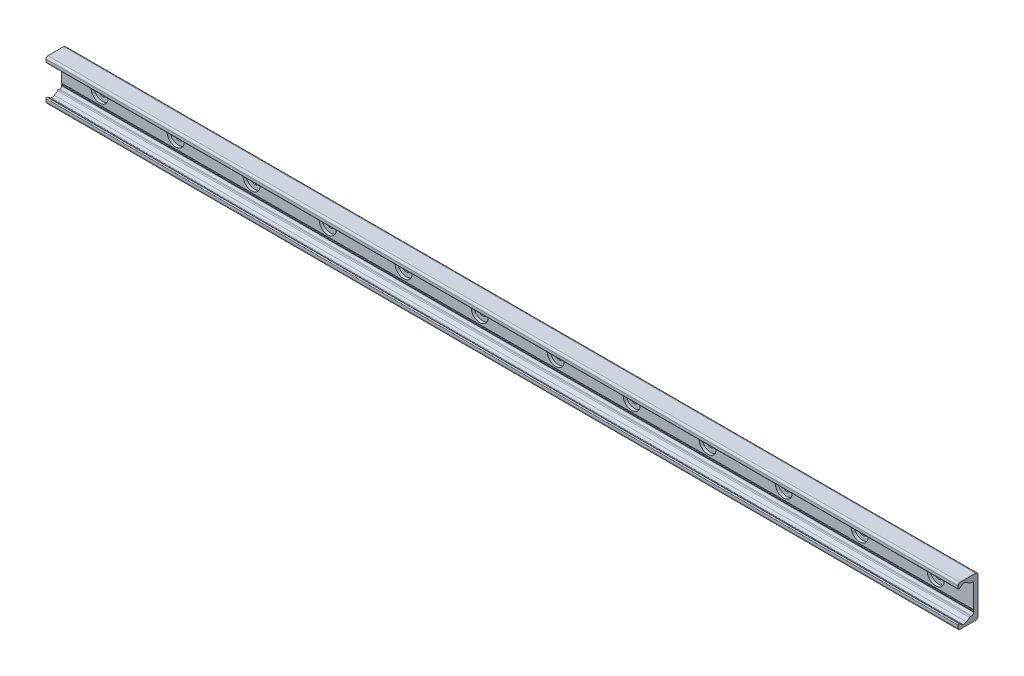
from build123d import *

# Parameters (mm, degrees)
BOSS_EXTRUDE1_DEPTH = 480
SKETCH2_R           = 9
SKETCH2_R_2         = 4.5
CUT_EXTRUDE1_DEPTH  = 3.1
SKETCH2_2_R         = 4.5
CUT_EXTRUDE2_DEPTH  = 481.764495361
LPATTERN1_COUNT     = 12
LPATTERN1_PITCH     = 80


with BuildPart() as part:
    # Sketch1 → Boss-Extrude1 (new, symmetric)
    with BuildSketch(Plane(origin=(0, 0, 0), x_dir=(0, 0, -1), z_dir=(1, 0, 0))):
        with BuildLine():
            Line((0, 0), (0, 19))
            ThreePointArc((0, 19), (-0.732233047, 20.767766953), (-2.5, 21.5))
            Line((-2.5, 21.5), (-19, 21.5))
            ThreePointArc((-19, 21.5), (-20.414213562, 20.914213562), (-21, 19.5))
            Line((-21, 19.5), (-21, 16.625057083))
            ThreePointArc((-21, 16.625057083), (-20.553251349, 15.888838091), (-19.693931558, 15.945160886))
            Line((-19.693931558, 15.945160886), (-16.794305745, 17.975500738))
            ThreePointArc((-16.794305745, 17.975500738), (-14.5, 18.69889256), (-12.205694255, 17.975500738))
            Line((-12.205694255, 17.975500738), (-8.829831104, 15.611695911))
            ThreePointArc((-8.829831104, 15.611695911), (-8.28408983, 15.342566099), (-7.682678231, 15.25))
            Line((-7.682678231, 15.25), (-6.5, 15.25))
            ThreePointArc((-6.5, 15.25), (-5.085786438, 14.664213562), (-4.5, 13.25))
            Line((-4.5, 13.25), (-4.5, -10.75))
            ThreePointArc((-4.5, -10.75), (-4.25, -11), (-4.5, -11.25))
            Line((-4.5, -11.25), (-4.5, -12.25))
            ThreePointArc((-4.5, -12.25), (-4.25, -12.5), (-4.5, -12.75))
            Line((-4.5, -12.75), (-4.5, -13.25))
            ThreePointArc((-4.5, -13.25), (-5.085786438, -14.664213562), (-6.5, -15.25))
            Line((-6.5, -15.25), (-7.682678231, -15.25))
            ThreePointArc((-7.682678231, -15.25), (-8.28408983, -15.342566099), (-8.829831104, -15.611695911))
            Line((-8.829831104, -15.611695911), (-12.205694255, -17.975500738))
            ThreePointArc((-12.205694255, -17.975500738), (-14.5, -18.69889256), (-16.794305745, -17.975500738))
            Line((-16.794305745, -17.975500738), (-19.693931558, -15.945160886))
            ThreePointArc((-19.693931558, -15.945160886), (-20.553251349, -15.888838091), (-21, -16.625057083))
            Line((-21, -16.625057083), (-21, -19.5))
            ThreePointArc((-21, -19.5), (-20.414213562, -20.914213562), (-19, -21.5))
            Line((-19, -21.5), (-2.5, -21.5))
            ThreePointArc((-2.5, -21.5), (-0.732233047, -20.767766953), (0, -19))
            Line((0, -19), (0, 0))
        make_face()
    extrude(amount=BOSS_EXTRUDE1_DEPTH, both=True)

    # Sketch2 → Cut-Extrude1 (cut)
    with BuildSketch(Plane.XY.offset(4.5)):
        with Locations((440, 0)):
            Circle(SKETCH2_R)
        with Locations((440, 0)):
            Circle(SKETCH2_R_2, mode=Mode.SUBTRACT)
    cut_extrude1 = extrude(amount=-CUT_EXTRUDE1_DEPTH, mode=Mode.SUBTRACT)

    # Sketch2_2 → Cut-Extrude2 (cut, through all)
    with BuildSketch(Plane.XY.offset(4.5)):
        with Locations((440, 0)):
            Circle(SKETCH2_2_R)
    cut_extrude2 = extrude(amount=-CUT_EXTRUDE2_DEPTH, mode=Mode.SUBTRACT)

    # LPattern1: Cut-Extrude1, Cut-Extrude2 ×12
    with Locations(*[(-i * LPATTERN1_PITCH, 0, 0) for i in range(1, LPATTERN1_COUNT)]):
        add(cut_extrude1, mode=Mode.SUBTRACT)
        add(cut_extrude2, mode=Mode.SUBTRACT)


solid = part.part
